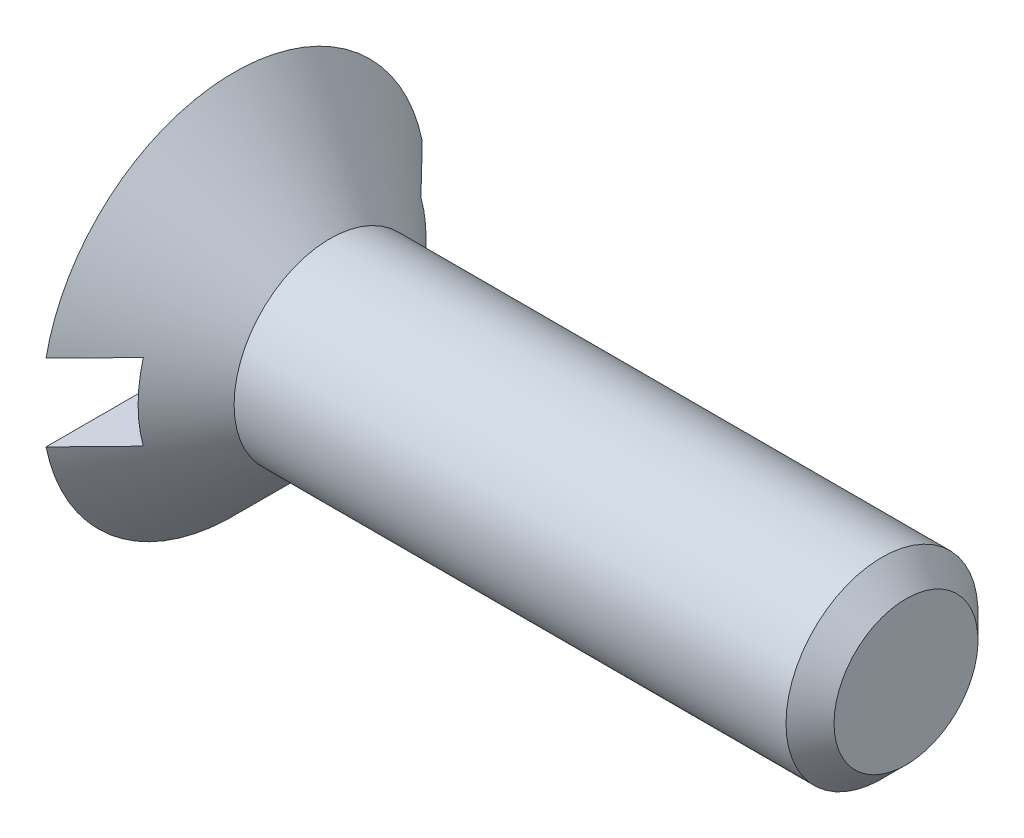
from build123d import *

# Parameters (mm, degrees)
CHANFREIN1_SIZE              = 0.25
ENL_V_MAT_EXTRU_1_DEPTH      = 8.549834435
ENL_V_MAT_EXTRU_1_DEPTH_BACK = 8.549834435
ESQUISSE2_W                  = 0.5
ESQUISSE2_H                  = 0.8


with BuildPart() as part:
    # Esquisse1 → R_volution1 (revolve)
    with BuildSketch(Plane.XY, mode=Mode.PRIVATE) as r_volution1_sk:
        Polygon((0, 0), (0, 2), (1, 1), (7, 1), (7, 0), align=None)
    revolve(r_volution1_sk.sketch.rotate(Axis((0, 0, 0), (1, 0, 0)), 90), axis=Axis((0, 0, 0), (1, 0, 0)))

    # Chanfrein1
    chanfrein1_edges = [part.edges().sort_by_distance(p)[0] for p in [
        (7, 0, -1),
    ]]
    chamfer(chanfrein1_edges, length=CHANFREIN1_SIZE)

    # Esquisse2 → Enl_v. mat.-Extru.1 (cut, two sides: drawn at the far end of the back side and taken through both)
    with BuildSketch(Plane.XY.offset(-ENL_V_MAT_EXTRU_1_DEPTH_BACK)):
        with Locations((0.25, 0)):
            Rectangle(ESQUISSE2_W, ESQUISSE2_H)
    extrude(amount=ENL_V_MAT_EXTRU_1_DEPTH + ENL_V_MAT_EXTRU_1_DEPTH_BACK, mode=Mode.SUBTRACT)


solid = part.part
